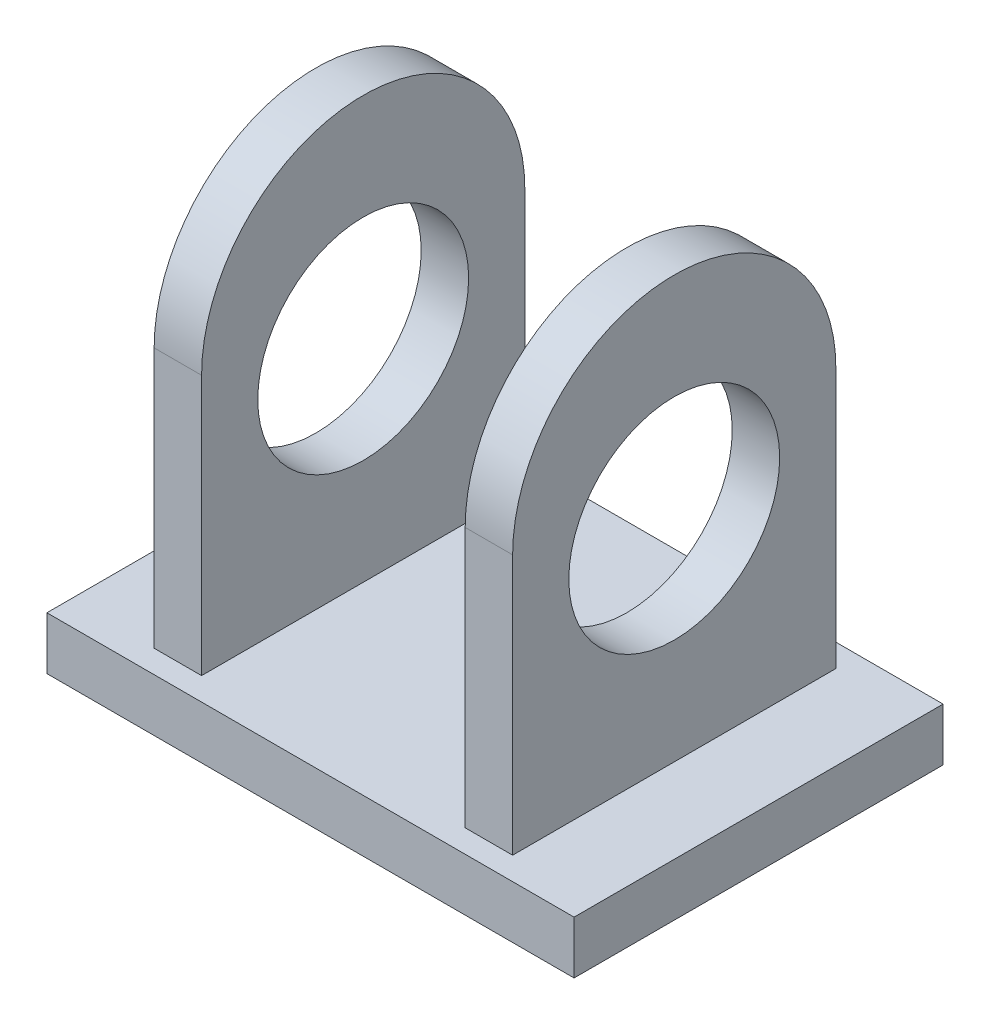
from build123d import *

# Parameters (mm, degrees)
SKETCH11_R          = 11.5
SKETCH11_R_2        = 10.5
BOSS_EXTRUDE4_DEPTH = 5
SKETCH12_W          = 50
SKETCH12_H          = 35
BOSS_EXTRUDE5_DEPTH = 5
SKETCH15_W          = 34
SKETCH15_H          = 30.657197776
BOSS_EXTRUDE6_DEPTH = 40
FILLET1_RADIUS      = 15.328598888
FILLET1_LENGTH      = 34
SKETCH16_W          = 25
SKETCH16_H          = 41.157237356
CUT_EXTRUDE4_DEPTH  = 65.828364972
SKETCH19_R          = 10
CUT_EXTRUDE5_DEPTH  = 51


with BuildPart() as part:
    # Sketch11 → Boss-Extrude4 (new body)
    with BuildSketch(Plane(origin=(0, 0, 0), x_dir=(1, 0, 0), z_dir=(0, 1, 0))):
        with Locations(Location((0, 0, 0), (0, 0, 270))):
            Circle(SKETCH11_R)
        with Locations(Location((0, 0, 0), (0, 0, 270))):
            Circle(SKETCH11_R_2, mode=Mode.SUBTRACT)
    extrude(amount=BOSS_EXTRUDE4_DEPTH)

    # Sketch12 → Boss-Extrude5 (add)
    with BuildSketch(Plane(origin=(0, 5, 0), x_dir=(1, 0, 0), z_dir=(0, 1, 0))):
        Rectangle(SKETCH12_W, SKETCH12_H)
    extrude(amount=BOSS_EXTRUDE5_DEPTH)

    # Sketch15 → Boss-Extrude6 (add)
    with BuildSketch(Plane(origin=(0, 10, 0), x_dir=(1, 0, 0), z_dir=(0, 1, 0))):
        Rectangle(SKETCH15_W, SKETCH15_H)
    extrude(amount=BOSS_EXTRUDE6_DEPTH)

    # Fillet1: full round fillet: the end face becomes a half cylinder, R = half its width
    fillet1_face = Plane((0, 50, 0), x_dir=(-1, 0, 0), z_dir=(0, 1, 0))  # on the end face: x along it, z out of the body
    fillet1_slab = fillet1_face.offset(-FILLET1_RADIUS / 2) * Box(FILLET1_LENGTH, 2 * FILLET1_RADIUS, FILLET1_RADIUS, mode=Mode.PRIVATE)  # the body's end, R deep
    fillet1_round = Plane((0, 34.671401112, 0), x_dir=(0, 1, 0), z_dir=(-1, 0, 0)) * Cylinder(FILLET1_RADIUS, FILLET1_LENGTH, mode=Mode.PRIVATE)  # its axis R under the face
    add(fillet1_slab - fillet1_round, mode=Mode.SUBTRACT)

    # Sketch16 → Cut-Extrude4 (cut, through all)
    with BuildSketch(Plane.XY.offset(15.328598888)):
        with Locations((0, 30.578618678)):
            Rectangle(SKETCH16_W, SKETCH16_H)
    extrude(amount=-CUT_EXTRUDE4_DEPTH, mode=Mode.SUBTRACT)

    # Sketch19 → Cut-Extrude5 (cut, symmetric)
    with BuildSketch(Plane.ZY.offset(17)):
        with Locations((0, 30)):
            Circle(SKETCH19_R)
    extrude(amount=CUT_EXTRUDE5_DEPTH, both=True, mode=Mode.SUBTRACT)


solid = part.part
